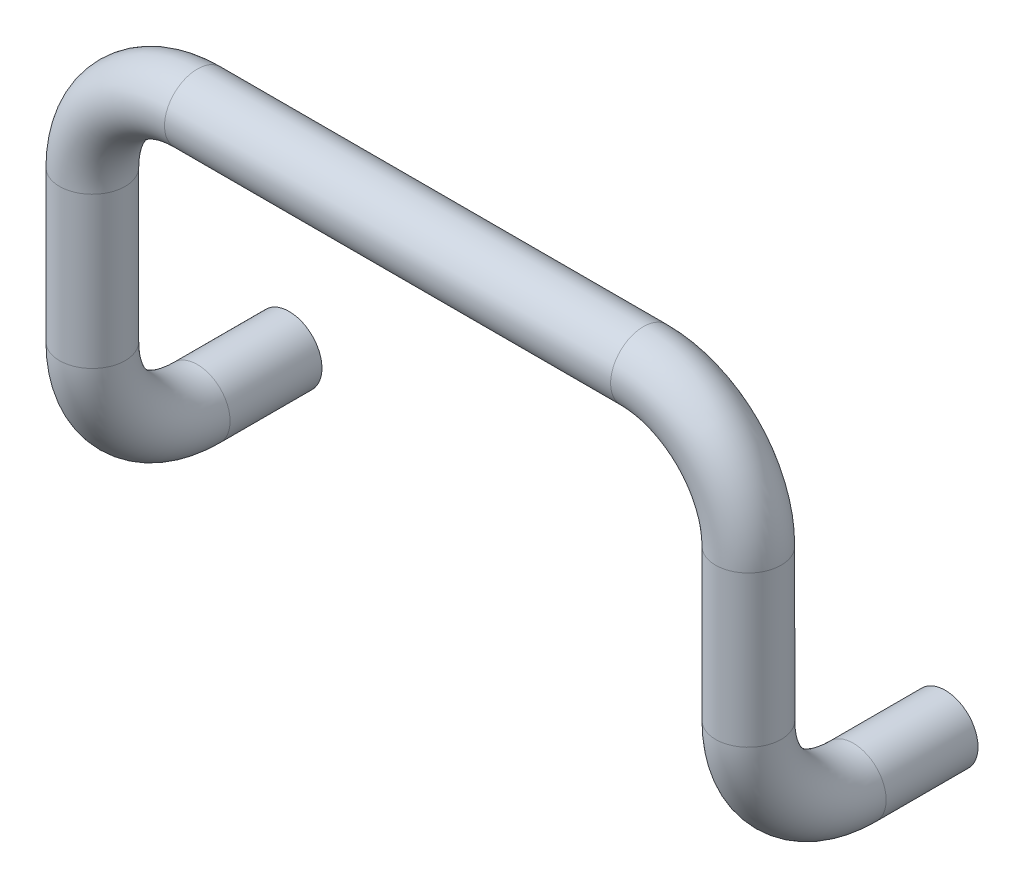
ISO-10303-21;
HEADER;
FILE_DESCRIPTION(('STEP AP214'),'2;1');
FILE_NAME('part.step','',(''),(''),'','','');
FILE_SCHEMA(('AUTOMOTIVE_DESIGN { 1 0 10303 214 1 1 1 1 }'));
ENDSEC;
DATA;
#1=APPLICATION_CONTEXT('core data for automotive mechanical design processes');
#2=APPLICATION_PROTOCOL_DEFINITION('international standard','automotive_design',2000,#1);
#3=PRODUCT_CONTEXT('',#1,'mechanical');
#4=PRODUCT('Part','Part','',(#3));
#5=PRODUCT_RELATED_PRODUCT_CATEGORY('part','',(#4));
#6=PRODUCT_DEFINITION_FORMATION('','',#4);
#7=PRODUCT_DEFINITION_CONTEXT('part definition',#1,'design');
#8=PRODUCT_DEFINITION('design','',#6,#7);
#9=PRODUCT_DEFINITION_SHAPE('','',#8);
#10=(LENGTH_UNIT() NAMED_UNIT(*) SI_UNIT(.MILLI.,.METRE.));
#11=(NAMED_UNIT(*) PLANE_ANGLE_UNIT() SI_UNIT($,.RADIAN.));
#12=(NAMED_UNIT(*) SI_UNIT($,.STERADIAN.) SOLID_ANGLE_UNIT());
#13=UNCERTAINTY_MEASURE_WITH_UNIT(LENGTH_MEASURE(1.E-05),#10,'distance_accuracy_value','');
#14=(GEOMETRIC_REPRESENTATION_CONTEXT(3) GLOBAL_UNCERTAINTY_ASSIGNED_CONTEXT((#13)) GLOBAL_UNIT_ASSIGNED_CONTEXT((#10,
#11,#12)) REPRESENTATION_CONTEXT('',''));
#15=CARTESIAN_POINT('',(0.,0.,0.));
#16=DIRECTION('',(0.,0.,1.));
#17=DIRECTION('',(1.,0.,0.));
#18=AXIS2_PLACEMENT_3D('',#15,#16,#17);
#19=CARTESIAN_POINT('',(0.,0.,28.));
#20=DIRECTION('',(0.,0.,-1.));
#21=DIRECTION('',(-1.,0.,0.));
#22=AXIS2_PLACEMENT_3D('',#19,#20,#21);
#23=CYLINDRICAL_SURFACE('',#22,10.);
#24=CARTESIAN_POINT('',(0.,0.,28.));
#25=DIRECTION('',(0.,0.,-1.));
#26=DIRECTION('',(-1.,0.,0.));
#27=AXIS2_PLACEMENT_3D('',#24,#25,#26);
#28=CIRCLE('',#27,10.);
#29=CARTESIAN_POINT('',(0.,-10.,28.));
#30=VERTEX_POINT('',#29);
#31=EDGE_CURVE('E35',#30,#30,#28,.T.);
#32=ORIENTED_EDGE('',*,*,#31,.T.);
#33=EDGE_LOOP('',(#32));
#34=FACE_BOUND('',#33,.T.);
#35=CARTESIAN_POINT('',(0.,0.,1.98246367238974E-13));
#36=DIRECTION('',(0.,0.,-1.));
#37=DIRECTION('',(-1.,0.,0.));
#38=AXIS2_PLACEMENT_3D('',#35,#36,#37);
#39=CIRCLE('',#38,10.);
#40=CARTESIAN_POINT('',(-10.,0.,1.89568763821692E-13));
#41=VERTEX_POINT('',#40);
#42=EDGE_CURVE('E32',#41,#41,#39,.T.);
#43=ORIENTED_EDGE('',*,*,#42,.F.);
#44=EDGE_LOOP('',(#43));
#45=FACE_BOUND('',#44,.T.);
#46=ADVANCED_FACE('F12',(#34,#45),#23,.T.);
#47=CARTESIAN_POINT('',(0.,32.,28.));
#48=DIRECTION('',(1.,0.,0.));
#49=DIRECTION('',(0.,1.,0.));
#50=AXIS2_PLACEMENT_3D('',#47,#48,#49);
#51=TOROIDAL_SURFACE('',#50,32.,10.);
#52=CARTESIAN_POINT('',(0.,32.,60.));
#53=DIRECTION('',(0.,-1.,0.));
#54=DIRECTION('',(-1.,0.,0.));
#55=AXIS2_PLACEMENT_3D('',#52,#53,#54);
#56=CIRCLE('',#55,10.);
#57=CARTESIAN_POINT('',(0.,32.,70.));
#58=VERTEX_POINT('',#57);
#59=EDGE_CURVE('E38',#58,#58,#56,.T.);
#60=CARTESIAN_POINT('',(0.,32.,28.));
#61=DIRECTION('',(1.,0.,0.));
#62=DIRECTION('',(0.,1.,0.));
#63=AXIS2_PLACEMENT_3D('',#60,#61,#62);
#64=CIRCLE('',#63,42.);
#65=EDGE_CURVE('',#58,#30,#64,.T.);
#66=ORIENTED_EDGE('',*,*,#59,.T.);
#67=ORIENTED_EDGE('',*,*,#31,.F.);
#68=ORIENTED_EDGE('',*,*,#65,.T.);
#69=ORIENTED_EDGE('',*,*,#65,.F.);
#70=EDGE_LOOP('',(#66,#68,#67,#69));
#71=FACE_BOUND('',#70,.T.);
#72=ADVANCED_FACE('F90',(#71),#51,.T.);
#73=CARTESIAN_POINT('',(0.,78.,60.));
#74=DIRECTION('',(0.,-1.,0.));
#75=DIRECTION('',(0.,0.,-1.));
#76=AXIS2_PLACEMENT_3D('',#73,#74,#75);
#77=CYLINDRICAL_SURFACE('',#76,10.);
#78=CARTESIAN_POINT('',(0.,78.,60.));
#79=DIRECTION('',(0.,-1.,0.));
#80=DIRECTION('',(-1.,0.,0.));
#81=AXIS2_PLACEMENT_3D('',#78,#79,#80);
#82=CIRCLE('',#81,10.);
#83=CARTESIAN_POINT('',(-10.,78.,60.));
#84=VERTEX_POINT('',#83);
#85=EDGE_CURVE('E41',#84,#84,#82,.T.);
#86=ORIENTED_EDGE('',*,*,#85,.T.);
#87=EDGE_LOOP('',(#86));
#88=FACE_BOUND('',#87,.T.);
#89=ORIENTED_EDGE('',*,*,#59,.F.);
#90=EDGE_LOOP('',(#89));
#91=FACE_BOUND('',#90,.T.);
#92=ADVANCED_FACE('F97',(#88,#91),#77,.T.);
#93=CARTESIAN_POINT('',(32.,78.,60.));
#94=DIRECTION('',(0.,0.,1.));
#95=DIRECTION('',(1.,0.,0.));
#96=AXIS2_PLACEMENT_3D('',#93,#94,#95);
#97=TOROIDAL_SURFACE('',#96,32.,10.);
#98=CARTESIAN_POINT('',(32.,110.,60.));
#99=DIRECTION('',(-1.,0.,0.));
#100=DIRECTION('',(0.,1.,0.));
#101=AXIS2_PLACEMENT_3D('',#98,#99,#100);
#102=CIRCLE('',#101,10.);
#103=CARTESIAN_POINT('',(32.,120.,60.));
#104=VERTEX_POINT('',#103);
#105=EDGE_CURVE('E44',#104,#104,#102,.T.);
#106=CARTESIAN_POINT('',(32.,78.,60.));
#107=DIRECTION('',(0.,0.,1.));
#108=DIRECTION('',(1.,0.,0.));
#109=AXIS2_PLACEMENT_3D('',#106,#107,#108);
#110=CIRCLE('',#109,42.);
#111=EDGE_CURVE('',#104,#84,#110,.T.);
#112=ORIENTED_EDGE('',*,*,#105,.T.);
#113=ORIENTED_EDGE('',*,*,#85,.F.);
#114=ORIENTED_EDGE('',*,*,#111,.T.);
#115=ORIENTED_EDGE('',*,*,#111,.F.);
#116=EDGE_LOOP('',(#112,#114,#113,#115));
#117=FACE_BOUND('',#116,.T.);
#118=ADVANCED_FACE('F104',(#117),#97,.T.);
#119=CARTESIAN_POINT('',(168.,110.,60.));
#120=DIRECTION('',(-1.,0.,0.));
#121=DIRECTION('',(0.,-1.,0.));
#122=AXIS2_PLACEMENT_3D('',#119,#120,#121);
#123=CYLINDRICAL_SURFACE('',#122,10.);
#124=CARTESIAN_POINT('',(168.,110.,60.));
#125=DIRECTION('',(-1.,0.,0.));
#126=DIRECTION('',(0.,1.,0.));
#127=AXIS2_PLACEMENT_3D('',#124,#125,#126);
#128=CIRCLE('',#127,10.);
#129=CARTESIAN_POINT('',(168.,120.,60.));
#130=VERTEX_POINT('',#129);
#131=EDGE_CURVE('E47',#130,#130,#128,.T.);
#132=ORIENTED_EDGE('',*,*,#131,.T.);
#133=EDGE_LOOP('',(#132));
#134=FACE_BOUND('',#133,.T.);
#135=ORIENTED_EDGE('',*,*,#105,.F.);
#136=EDGE_LOOP('',(#135));
#137=FACE_BOUND('',#136,.T.);
#138=ADVANCED_FACE('F108',(#134,#137),#123,.T.);
#139=CARTESIAN_POINT('',(168.,78.,60.));
#140=DIRECTION('',(0.,0.,1.));
#141=DIRECTION('',(1.,0.,0.));
#142=AXIS2_PLACEMENT_3D('',#139,#140,#141);
#143=TOROIDAL_SURFACE('',#142,32.,10.);
#144=CARTESIAN_POINT('',(200.,78.,60.));
#145=DIRECTION('',(0.,1.,0.));
#146=DIRECTION('',(1.,0.,0.));
#147=AXIS2_PLACEMENT_3D('',#144,#145,#146);
#148=CIRCLE('',#147,10.);
#149=CARTESIAN_POINT('',(210.,78.,60.));
#150=VERTEX_POINT('',#149);
#151=EDGE_CURVE('E50',#150,#150,#148,.T.);
#152=CARTESIAN_POINT('',(168.,78.,60.));
#153=DIRECTION('',(0.,0.,1.));
#154=DIRECTION('',(1.,0.,0.));
#155=AXIS2_PLACEMENT_3D('',#152,#153,#154);
#156=CIRCLE('',#155,42.);
#157=EDGE_CURVE('',#150,#130,#156,.T.);
#158=ORIENTED_EDGE('',*,*,#151,.T.);
#159=ORIENTED_EDGE('',*,*,#131,.F.);
#160=ORIENTED_EDGE('',*,*,#157,.T.);
#161=ORIENTED_EDGE('',*,*,#157,.F.);
#162=EDGE_LOOP('',(#158,#160,#159,#161));
#163=FACE_BOUND('',#162,.T.);
#164=ADVANCED_FACE('F112',(#163),#143,.T.);
#165=CARTESIAN_POINT('',(200.,32.,60.));
#166=DIRECTION('',(0.,1.,0.));
#167=DIRECTION('',(0.,0.,1.));
#168=AXIS2_PLACEMENT_3D('',#165,#166,#167);
#169=CYLINDRICAL_SURFACE('',#168,10.);
#170=CARTESIAN_POINT('',(200.,32.,60.));
#171=DIRECTION('',(0.,1.,0.));
#172=DIRECTION('',(1.,0.,0.));
#173=AXIS2_PLACEMENT_3D('',#170,#171,#172);
#174=CIRCLE('',#173,10.);
#175=CARTESIAN_POINT('',(200.,32.,70.));
#176=VERTEX_POINT('',#175);
#177=EDGE_CURVE('E53',#176,#176,#174,.T.);
#178=ORIENTED_EDGE('',*,*,#177,.T.);
#179=EDGE_LOOP('',(#178));
#180=FACE_BOUND('',#179,.T.);
#181=ORIENTED_EDGE('',*,*,#151,.F.);
#182=EDGE_LOOP('',(#181));
#183=FACE_BOUND('',#182,.T.);
#184=ADVANCED_FACE('F116',(#180,#183),#169,.T.);
#185=CARTESIAN_POINT('',(200.,32.,28.));
#186=DIRECTION('',(-1.,0.,0.));
#187=DIRECTION('',(0.,-1.,0.));
#188=AXIS2_PLACEMENT_3D('',#185,#186,#187);
#189=TOROIDAL_SURFACE('',#188,32.,10.);
#190=CARTESIAN_POINT('',(200.,0.,28.));
#191=DIRECTION('',(0.,0.,1.));
#192=DIRECTION('',(1.,0.,0.));
#193=AXIS2_PLACEMENT_3D('',#190,#191,#192);
#194=CIRCLE('',#193,10.);
#195=CARTESIAN_POINT('',(200.,-10.,28.));
#196=VERTEX_POINT('',#195);
#197=EDGE_CURVE('E56',#196,#196,#194,.T.);
#198=CARTESIAN_POINT('',(200.,32.,28.));
#199=DIRECTION('',(-1.,0.,0.));
#200=DIRECTION('',(0.,-1.,0.));
#201=AXIS2_PLACEMENT_3D('',#198,#199,#200);
#202=CIRCLE('',#201,42.);
#203=EDGE_CURVE('',#196,#176,#202,.T.);
#204=ORIENTED_EDGE('',*,*,#197,.T.);
#205=ORIENTED_EDGE('',*,*,#177,.F.);
#206=ORIENTED_EDGE('',*,*,#203,.T.);
#207=ORIENTED_EDGE('',*,*,#203,.F.);
#208=EDGE_LOOP('',(#204,#206,#205,#207));
#209=FACE_BOUND('',#208,.T.);
#210=ADVANCED_FACE('F120',(#209),#189,.T.);
#211=CARTESIAN_POINT('',(200.,0.,28.));
#212=DIRECTION('',(0.,0.,-1.));
#213=DIRECTION('',(-1.,0.,0.));
#214=AXIS2_PLACEMENT_3D('',#211,#212,#213);
#215=CYLINDRICAL_SURFACE('',#214,10.);
#216=ORIENTED_EDGE('',*,*,#197,.F.);
#217=EDGE_LOOP('',(#216));
#218=FACE_BOUND('',#217,.T.);
#219=CARTESIAN_POINT('',(200.,0.,1.73552068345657E-13));
#220=DIRECTION('',(0.,0.,1.));
#221=DIRECTION('',(1.,0.,0.));
#222=AXIS2_PLACEMENT_3D('',#219,#220,#221);
#223=CIRCLE('',#222,10.);
#224=CARTESIAN_POINT('',(210.,0.,1.74572493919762E-13));
#225=VERTEX_POINT('',#224);
#226=EDGE_CURVE('E59',#225,#225,#223,.T.);
#227=ORIENTED_EDGE('',*,*,#226,.T.);
#228=EDGE_LOOP('',(#227));
#229=FACE_BOUND('',#228,.T.);
#230=ADVANCED_FACE('F124',(#218,#229),#215,.T.);
#231=CARTESIAN_POINT('',(0.,0.,1.98246367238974E-13));
#232=DIRECTION('',(0.,0.,-1.));
#233=DIRECTION('',(-1.,0.,0.));
#234=AXIS2_PLACEMENT_3D('',#231,#232,#233);
#235=PLANE('',#234);
#236=CARTESIAN_POINT('',(0.,0.,1.98246367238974E-13));
#237=DIRECTION('',(0.,0.,-1.));
#238=DIRECTION('',(-1.,0.,0.));
#239=AXIS2_PLACEMENT_3D('',#236,#237,#238);
#240=CIRCLE('',#239,4.49999999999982);
#241=CARTESIAN_POINT('',(-4.49999999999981,0.,1.94341445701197E-13));
#242=VERTEX_POINT('',#241);
#243=EDGE_CURVE('E23',#242,#242,#240,.F.);
#244=ORIENTED_EDGE('',*,*,#243,.T.);
#245=EDGE_LOOP('',(#244));
#246=FACE_BOUND('',#245,.T.);
#247=ORIENTED_EDGE('',*,*,#42,.T.);
#248=EDGE_LOOP('',(#247));
#249=FACE_BOUND('',#248,.T.);
#250=ADVANCED_FACE('F126',(#246,#249),#235,.T.);
#251=CARTESIAN_POINT('',(200.,0.,1.73552068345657E-13));
#252=DIRECTION('',(0.,0.,1.));
#253=DIRECTION('',(1.,0.,0.));
#254=AXIS2_PLACEMENT_3D('',#251,#252,#253);
#255=PLANE('',#254);
#256=CARTESIAN_POINT('',(200.,0.,1.73552068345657E-13));
#257=DIRECTION('',(0.,0.,1.));
#258=DIRECTION('',(0.,-1.,0.));
#259=AXIS2_PLACEMENT_3D('',#256,#257,#258);
#260=CIRCLE('',#259,4.5);
#261=CARTESIAN_POINT('',(200.,-4.49999999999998,1.72873263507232E-13));
#262=VERTEX_POINT('',#261);
#263=EDGE_CURVE('E8',#262,#262,#260,.T.);
#264=ORIENTED_EDGE('',*,*,#263,.T.);
#265=EDGE_LOOP('',(#264));
#266=FACE_BOUND('',#265,.T.);
#267=ORIENTED_EDGE('',*,*,#226,.F.);
#268=EDGE_LOOP('',(#267));
#269=FACE_BOUND('',#268,.T.);
#270=ADVANCED_FACE('F86',(#266,#269),#255,.F.);
#271=CARTESIAN_POINT('',(0.,0.,15.));
#272=DIRECTION('',(0.,0.,-1.));
#273=DIRECTION('',(-1.,0.,0.));
#274=AXIS2_PLACEMENT_3D('',#271,#272,#273);
#275=CYLINDRICAL_SURFACE('',#274,4.);
#276=CARTESIAN_POINT('',(0.,0.,0.500000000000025));
#277=DIRECTION('',(0.,0.,-1.));
#278=DIRECTION('',(-1.,0.,0.));
#279=AXIS2_PLACEMENT_3D('',#276,#277,#278);
#280=CIRCLE('',#279,4.);
#281=CARTESIAN_POINT('',(-3.99999999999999,0.,0.500000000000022));
#282=VERTEX_POINT('',#281);
#283=EDGE_CURVE('E27',#282,#282,#280,.T.);
#284=ORIENTED_EDGE('',*,*,#283,.T.);
#285=EDGE_LOOP('',(#284));
#286=FACE_BOUND('',#285,.T.);
#287=CARTESIAN_POINT('',(0.,0.,15.));
#288=DIRECTION('',(0.,0.,-1.));
#289=DIRECTION('',(-1.,0.,0.));
#290=AXIS2_PLACEMENT_3D('',#287,#288,#289);
#291=CIRCLE('',#290,4.);
#292=CARTESIAN_POINT('',(-4.,0.,15.));
#293=VERTEX_POINT('',#292);
#294=EDGE_CURVE('E62',#293,#293,#291,.T.);
#295=ORIENTED_EDGE('',*,*,#294,.F.);
#296=EDGE_LOOP('',(#295));
#297=FACE_BOUND('',#296,.T.);
#298=ADVANCED_FACE('F83',(#286,#297),#275,.F.);
#299=CARTESIAN_POINT('',(0.,0.,15.));
#300=DIRECTION('',(0.,0.,-1.));
#301=DIRECTION('',(-1.,0.,0.));
#302=AXIS2_PLACEMENT_3D('',#299,#300,#301);
#303=PLANE('',#302);
#304=ORIENTED_EDGE('',*,*,#294,.T.);
#305=EDGE_LOOP('',(#304));
#306=FACE_BOUND('',#305,.T.);
#307=ADVANCED_FACE('F73',(#306),#303,.T.);
#308=CARTESIAN_POINT('',(200.,0.,15.));
#309=DIRECTION('',(0.,0.,-1.));
#310=DIRECTION('',(-1.,0.,0.));
#311=AXIS2_PLACEMENT_3D('',#308,#309,#310);
#312=CYLINDRICAL_SURFACE('',#311,4.);
#313=CARTESIAN_POINT('',(200.,0.,0.500000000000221));
#314=DIRECTION('',(0.,0.,1.));
#315=DIRECTION('',(0.,-1.,0.));
#316=AXIS2_PLACEMENT_3D('',#313,#314,#315);
#317=CIRCLE('',#316,4.);
#318=CARTESIAN_POINT('',(200.,-3.99999999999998,0.50000000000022));
#319=VERTEX_POINT('',#318);
#320=EDGE_CURVE('E19',#319,#319,#317,.F.);
#321=ORIENTED_EDGE('',*,*,#320,.T.);
#322=EDGE_LOOP('',(#321));
#323=FACE_BOUND('',#322,.T.);
#324=CARTESIAN_POINT('',(200.,0.,15.));
#325=DIRECTION('',(0.,0.,-1.));
#326=DIRECTION('',(-1.,0.,0.));
#327=AXIS2_PLACEMENT_3D('',#324,#325,#326);
#328=CIRCLE('',#327,4.);
#329=CARTESIAN_POINT('',(196.,0.,15.));
#330=VERTEX_POINT('',#329);
#331=EDGE_CURVE('E65',#330,#330,#328,.T.);
#332=ORIENTED_EDGE('',*,*,#331,.F.);
#333=EDGE_LOOP('',(#332));
#334=FACE_BOUND('',#333,.T.);
#335=ADVANCED_FACE('F71',(#323,#334),#312,.F.);
#336=CARTESIAN_POINT('',(200.,0.,15.));
#337=DIRECTION('',(0.,0.,-1.));
#338=DIRECTION('',(-1.,0.,0.));
#339=AXIS2_PLACEMENT_3D('',#336,#337,#338);
#340=PLANE('',#339);
#341=ORIENTED_EDGE('',*,*,#331,.T.);
#342=EDGE_LOOP('',(#341));
#343=FACE_BOUND('',#342,.T.);
#344=ADVANCED_FACE('F69',(#343),#340,.T.);
#345=CARTESIAN_POINT('',(0.,0.,0.500000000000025));
#346=DIRECTION('',(0.,0.,-1.));
#347=DIRECTION('',(-1.,0.,0.));
#348=AXIS2_PLACEMENT_3D('',#345,#346,#347);
#349=CONICAL_SURFACE('',#348,4.,0.785398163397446);
#350=ORIENTED_EDGE('',*,*,#243,.F.);
#351=EDGE_LOOP('',(#350));
#352=FACE_BOUND('',#351,.T.);
#353=ORIENTED_EDGE('',*,*,#283,.F.);
#354=EDGE_LOOP('',(#353));
#355=FACE_BOUND('',#354,.T.);
#356=ADVANCED_FACE('F75',(#352,#355),#349,.F.);
#357=CARTESIAN_POINT('',(200.,0.,0.500000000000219));
#358=DIRECTION('',(0.,0.,-1.));
#359=DIRECTION('',(0.,1.,0.));
#360=AXIS2_PLACEMENT_3D('',#357,#358,#359);
#361=CONICAL_SURFACE('',#360,4.,0.785398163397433);
#362=ORIENTED_EDGE('',*,*,#263,.F.);
#363=EDGE_LOOP('',(#362));
#364=FACE_BOUND('',#363,.T.);
#365=ORIENTED_EDGE('',*,*,#320,.F.);
#366=EDGE_LOOP('',(#365));
#367=FACE_BOUND('',#366,.T.);
#368=ADVANCED_FACE('F14',(#364,#367),#361,.F.);
#369=CLOSED_SHELL('',(#46,#72,#92,#118,#138,#164,#184,#210,#230,#250,#270,#298,#307,#335,#344,
#356,#368));
#370=MANIFOLD_SOLID_BREP('B1',#369);
#371=ADVANCED_BREP_SHAPE_REPRESENTATION('',(#18,#370),#14);
#372=SHAPE_DEFINITION_REPRESENTATION(#9,#371);
ENDSEC;
END-ISO-10303-21;
